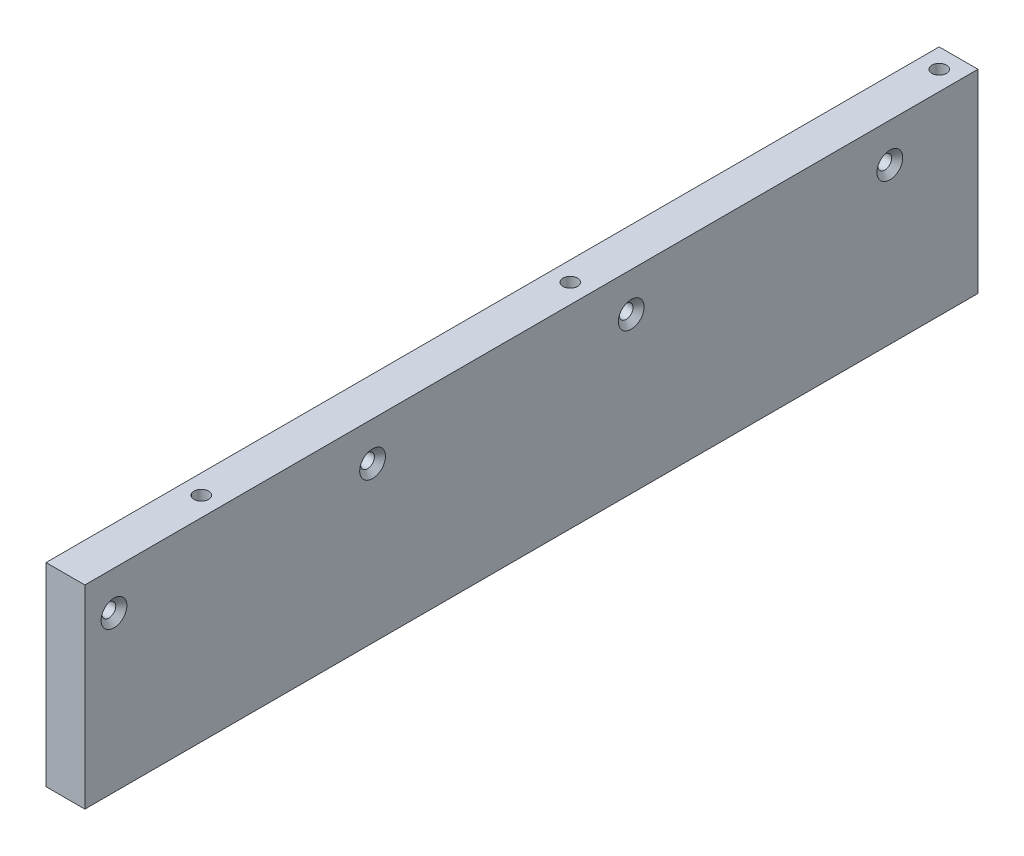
ISO-10303-21;
HEADER;
FILE_DESCRIPTION(('STEP AP214'),'2;1');
FILE_NAME('part.step','',(''),(''),'','','');
FILE_SCHEMA(('AUTOMOTIVE_DESIGN { 1 0 10303 214 1 1 1 1 }'));
ENDSEC;
DATA;
#1=APPLICATION_CONTEXT('core data for automotive mechanical design processes');
#2=APPLICATION_PROTOCOL_DEFINITION('international standard','automotive_design',2000,#1);
#3=PRODUCT_CONTEXT('',#1,'mechanical');
#4=PRODUCT('Part','Part','',(#3));
#5=PRODUCT_RELATED_PRODUCT_CATEGORY('part','',(#4));
#6=PRODUCT_DEFINITION_FORMATION('','',#4);
#7=PRODUCT_DEFINITION_CONTEXT('part definition',#1,'design');
#8=PRODUCT_DEFINITION('design','',#6,#7);
#9=PRODUCT_DEFINITION_SHAPE('','',#8);
#10=(LENGTH_UNIT() NAMED_UNIT(*) SI_UNIT(.MILLI.,.METRE.));
#11=(NAMED_UNIT(*) PLANE_ANGLE_UNIT() SI_UNIT($,.RADIAN.));
#12=(NAMED_UNIT(*) SI_UNIT($,.STERADIAN.) SOLID_ANGLE_UNIT());
#13=UNCERTAINTY_MEASURE_WITH_UNIT(LENGTH_MEASURE(1.E-05),#10,'distance_accuracy_value','');
#14=(GEOMETRIC_REPRESENTATION_CONTEXT(3) GLOBAL_UNCERTAINTY_ASSIGNED_CONTEXT((#13)) GLOBAL_UNIT_ASSIGNED_CONTEXT((#10,
#11,#12)) REPRESENTATION_CONTEXT('',''));
#15=CARTESIAN_POINT('',(0.,0.,0.));
#16=DIRECTION('',(0.,0.,1.));
#17=DIRECTION('',(1.,0.,0.));
#18=AXIS2_PLACEMENT_3D('',#15,#16,#17);
#19=CARTESIAN_POINT('',(61.9125,0.,88.8999999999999));
#20=DIRECTION('',(0.,-1.,0.));
#21=DIRECTION('',(0.,0.,-1.));
#22=AXIS2_PLACEMENT_3D('',#19,#20,#21);
#23=CYLINDRICAL_SURFACE('',#22,1.63194999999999);
#24=CARTESIAN_POINT('',(61.9125,0.,88.8999999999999));
#25=DIRECTION('',(0.,-1.,0.));
#26=DIRECTION('',(0.,0.,-1.));
#27=AXIS2_PLACEMENT_3D('',#24,#25,#26);
#28=CIRCLE('',#27,1.63194999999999);
#29=CARTESIAN_POINT('',(61.9125,0.,87.26805));
#30=VERTEX_POINT('',#29);
#31=EDGE_CURVE('E170',#30,#30,#28,.T.);
#32=ORIENTED_EDGE('',*,*,#31,.T.);
#33=EDGE_LOOP('',(#32));
#34=FACE_BOUND('',#33,.T.);
#35=CARTESIAN_POINT('',(61.9125,12.7,88.8999999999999));
#36=DIRECTION('',(0.,1.,0.));
#37=DIRECTION('',(0.,0.,1.));
#38=AXIS2_PLACEMENT_3D('',#35,#36,#37);
#39=CIRCLE('',#38,1.63194999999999);
#40=CARTESIAN_POINT('',(61.9125,12.7,90.5319499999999));
#41=VERTEX_POINT('',#40);
#42=EDGE_CURVE('E38',#41,#41,#39,.F.);
#43=ORIENTED_EDGE('',*,*,#42,.F.);
#44=EDGE_LOOP('',(#43));
#45=FACE_BOUND('',#44,.T.);
#46=ADVANCED_FACE('F34',(#34,#45),#23,.F.);
#47=CARTESIAN_POINT('',(61.9125,0.,-31.75));
#48=DIRECTION('',(0.,-1.,0.));
#49=DIRECTION('',(0.,0.,-1.));
#50=AXIS2_PLACEMENT_3D('',#47,#48,#49);
#51=CYLINDRICAL_SURFACE('',#50,1.63194999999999);
#52=CARTESIAN_POINT('',(61.9125,0.,-31.75));
#53=DIRECTION('',(0.,-1.,0.));
#54=DIRECTION('',(0.,0.,-1.));
#55=AXIS2_PLACEMENT_3D('',#52,#53,#54);
#56=CIRCLE('',#55,1.63194999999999);
#57=CARTESIAN_POINT('',(61.9125,0.,-33.38195));
#58=VERTEX_POINT('',#57);
#59=EDGE_CURVE('E173',#58,#58,#56,.T.);
#60=ORIENTED_EDGE('',*,*,#59,.T.);
#61=EDGE_LOOP('',(#60));
#62=FACE_BOUND('',#61,.T.);
#63=CARTESIAN_POINT('',(61.9125,12.7,-31.75));
#64=DIRECTION('',(0.,1.,0.));
#65=DIRECTION('',(0.,0.,1.));
#66=AXIS2_PLACEMENT_3D('',#63,#64,#65);
#67=CIRCLE('',#66,1.63194999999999);
#68=CARTESIAN_POINT('',(61.9125,12.7,-30.11805));
#69=VERTEX_POINT('',#68);
#70=EDGE_CURVE('E114',#69,#69,#67,.F.);
#71=ORIENTED_EDGE('',*,*,#70,.F.);
#72=EDGE_LOOP('',(#71));
#73=FACE_BOUND('',#72,.T.);
#74=ADVANCED_FACE('F202',(#62,#73),#51,.F.);
#75=CARTESIAN_POINT('',(61.9125,0.,-152.4));
#76=DIRECTION('',(0.,-1.,0.));
#77=DIRECTION('',(0.,0.,-1.));
#78=AXIS2_PLACEMENT_3D('',#75,#76,#77);
#79=CYLINDRICAL_SURFACE('',#78,1.63194999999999);
#80=CARTESIAN_POINT('',(61.9125,0.,-152.4));
#81=DIRECTION('',(0.,-1.,0.));
#82=DIRECTION('',(0.,0.,-1.));
#83=AXIS2_PLACEMENT_3D('',#80,#81,#82);
#84=CIRCLE('',#83,1.63194999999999);
#85=CARTESIAN_POINT('',(61.9125,0.,-154.03195));
#86=VERTEX_POINT('',#85);
#87=EDGE_CURVE('E104',#86,#86,#84,.T.);
#88=ORIENTED_EDGE('',*,*,#87,.T.);
#89=EDGE_LOOP('',(#88));
#90=FACE_BOUND('',#89,.T.);
#91=CARTESIAN_POINT('',(61.9125,12.7,-152.4));
#92=DIRECTION('',(0.,1.,0.));
#93=DIRECTION('',(0.,0.,1.));
#94=AXIS2_PLACEMENT_3D('',#91,#92,#93);
#95=CIRCLE('',#94,1.63194999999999);
#96=CARTESIAN_POINT('',(61.9125,12.7,-150.76805));
#97=VERTEX_POINT('',#96);
#98=EDGE_CURVE('E110',#97,#97,#95,.F.);
#99=ORIENTED_EDGE('',*,*,#98,.F.);
#100=EDGE_LOOP('',(#99));
#101=FACE_BOUND('',#100,.T.);
#102=ADVANCED_FACE('F179',(#90,#101),#79,.F.);
#103=CARTESIAN_POINT('',(68.2625,63.5,133.35));
#104=DIRECTION('',(-1.,0.,0.));
#105=DIRECTION('',(0.,0.,1.));
#106=AXIS2_PLACEMENT_3D('',#103,#104,#105);
#107=PLANE('',#106);
#108=CARTESIAN_POINT('',(68.2625,50.8,123.825));
#109=DIRECTION('',(1.,0.,0.));
#110=DIRECTION('',(0.,0.,-1.));
#111=AXIS2_PLACEMENT_3D('',#108,#109,#110);
#112=CIRCLE('',#111,4.2164);
#113=CARTESIAN_POINT('',(68.2625,50.8,119.6086));
#114=VERTEX_POINT('',#113);
#115=EDGE_CURVE('E140',#114,#114,#112,.T.);
#116=ORIENTED_EDGE('',*,*,#115,.F.);
#117=EDGE_LOOP('',(#116));
#118=FACE_BOUND('',#117,.T.);
#119=CARTESIAN_POINT('',(68.2625,50.8,-45.3390000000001));
#120=DIRECTION('',(1.,0.,0.));
#121=DIRECTION('',(0.,0.,-1.));
#122=AXIS2_PLACEMENT_3D('',#119,#120,#121);
#123=CIRCLE('',#122,4.2164);
#124=CARTESIAN_POINT('',(68.2625,50.8,-49.5554000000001));
#125=VERTEX_POINT('',#124);
#126=EDGE_CURVE('E149',#125,#125,#123,.T.);
#127=ORIENTED_EDGE('',*,*,#126,.F.);
#128=EDGE_LOOP('',(#127));
#129=FACE_BOUND('',#128,.T.);
#130=CARTESIAN_POINT('',(68.2625,50.8,-129.921));
#131=DIRECTION('',(1.,0.,0.));
#132=DIRECTION('',(0.,0.,-1.));
#133=AXIS2_PLACEMENT_3D('',#130,#131,#132);
#134=CIRCLE('',#133,4.2164);
#135=CARTESIAN_POINT('',(68.2625,50.8,-134.1374));
#136=VERTEX_POINT('',#135);
#137=EDGE_CURVE('E158',#136,#136,#134,.T.);
#138=ORIENTED_EDGE('',*,*,#137,.F.);
#139=EDGE_LOOP('',(#138));
#140=FACE_BOUND('',#139,.T.);
#141=CARTESIAN_POINT('',(68.2625,50.8,39.243));
#142=DIRECTION('',(1.,0.,0.));
#143=DIRECTION('',(0.,0.,-1.));
#144=AXIS2_PLACEMENT_3D('',#141,#142,#143);
#145=CIRCLE('',#144,4.2164);
#146=CARTESIAN_POINT('',(68.2625,50.8,35.0266));
#147=VERTEX_POINT('',#146);
#148=EDGE_CURVE('E167',#147,#147,#145,.T.);
#149=ORIENTED_EDGE('',*,*,#148,.F.);
#150=EDGE_LOOP('',(#149));
#151=FACE_BOUND('',#150,.T.);
#152=DIRECTION('',(0.,0.,-1.));
#153=VECTOR('',#152,1.);
#154=CARTESIAN_POINT('',(68.2625,0.,133.35));
#155=LINE('',#154,#153);
#156=CARTESIAN_POINT('',(68.2625,0.,133.35));
#157=VERTEX_POINT('',#156);
#158=CARTESIAN_POINT('',(68.2625,0.,-158.75));
#159=VERTEX_POINT('',#158);
#160=EDGE_CURVE('E101',#157,#159,#155,.T.);
#161=ORIENTED_EDGE('',*,*,#160,.T.);
#162=DIRECTION('',(0.,-1.,0.));
#163=VECTOR('',#162,1.);
#164=CARTESIAN_POINT('',(68.2625,63.5,-158.75));
#165=LINE('',#164,#163);
#166=CARTESIAN_POINT('',(68.2625,63.5,-158.75));
#167=VERTEX_POINT('',#166);
#168=EDGE_CURVE('E11',#167,#159,#165,.T.);
#169=ORIENTED_EDGE('',*,*,#168,.F.);
#170=DIRECTION('',(0.,0.,-1.));
#171=VECTOR('',#170,1.);
#172=CARTESIAN_POINT('',(68.2625,63.5,133.35));
#173=LINE('',#172,#171);
#174=CARTESIAN_POINT('',(68.2625,63.5,133.35));
#175=VERTEX_POINT('',#174);
#176=EDGE_CURVE('E88',#175,#167,#173,.T.);
#177=ORIENTED_EDGE('',*,*,#176,.F.);
#178=DIRECTION('',(0.,-1.,0.));
#179=VECTOR('',#178,1.);
#180=CARTESIAN_POINT('',(68.2625,63.5,133.35));
#181=LINE('',#180,#179);
#182=EDGE_CURVE('E97',#175,#157,#181,.T.);
#183=ORIENTED_EDGE('',*,*,#182,.T.);
#184=EDGE_LOOP('',(#161,#169,#177,#183));
#185=FACE_BOUND('',#184,.T.);
#186=ADVANCED_FACE('F36',(#118,#129,#140,#151,#185),#107,.F.);
#187=CARTESIAN_POINT('',(68.2625,63.5,-158.75));
#188=DIRECTION('',(0.,0.,1.));
#189=DIRECTION('',(1.,0.,0.));
#190=AXIS2_PLACEMENT_3D('',#187,#188,#189);
#191=PLANE('',#190);
#192=DIRECTION('',(-1.,0.,0.));
#193=VECTOR('',#192,1.);
#194=CARTESIAN_POINT('',(68.2625,0.,-158.75));
#195=LINE('',#194,#193);
#196=CARTESIAN_POINT('',(55.5625,0.,-158.75));
#197=VERTEX_POINT('',#196);
#198=EDGE_CURVE('E92',#159,#197,#195,.T.);
#199=ORIENTED_EDGE('',*,*,#198,.T.);
#200=DIRECTION('',(0.,-1.,0.));
#201=VECTOR('',#200,1.);
#202=CARTESIAN_POINT('',(55.5625,63.5,-158.75));
#203=LINE('',#202,#201);
#204=CARTESIAN_POINT('',(55.5625,63.5,-158.75));
#205=VERTEX_POINT('',#204);
#206=EDGE_CURVE('E44',#205,#197,#203,.T.);
#207=ORIENTED_EDGE('',*,*,#206,.F.);
#208=DIRECTION('',(-1.,0.,0.));
#209=VECTOR('',#208,1.);
#210=CARTESIAN_POINT('',(68.2625,63.5,-158.75));
#211=LINE('',#210,#209);
#212=EDGE_CURVE('E83',#167,#205,#211,.T.);
#213=ORIENTED_EDGE('',*,*,#212,.F.);
#214=ORIENTED_EDGE('',*,*,#168,.T.);
#215=EDGE_LOOP('',(#199,#207,#213,#214));
#216=FACE_BOUND('',#215,.T.);
#217=ADVANCED_FACE('F91',(#216),#191,.F.);
#218=CARTESIAN_POINT('',(55.5625,63.5,133.35));
#219=DIRECTION('',(1.,0.,0.));
#220=DIRECTION('',(0.,0.,-1.));
#221=AXIS2_PLACEMENT_3D('',#218,#219,#220);
#222=PLANE('',#221);
#223=CARTESIAN_POINT('',(55.5625,50.8,123.825));
#224=DIRECTION('',(1.,0.,0.));
#225=DIRECTION('',(0.,0.,-1.));
#226=AXIS2_PLACEMENT_3D('',#223,#224,#225);
#227=CIRCLE('',#226,2.2479);
#228=CARTESIAN_POINT('',(55.5625,50.8,121.5771));
#229=VERTEX_POINT('',#228);
#230=EDGE_CURVE('E112',#229,#229,#227,.T.);
#231=ORIENTED_EDGE('',*,*,#230,.T.);
#232=EDGE_LOOP('',(#231));
#233=FACE_BOUND('',#232,.T.);
#234=CARTESIAN_POINT('',(55.5625,50.8,-45.3390000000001));
#235=DIRECTION('',(1.,0.,0.));
#236=DIRECTION('',(0.,0.,-1.));
#237=AXIS2_PLACEMENT_3D('',#234,#235,#236);
#238=CIRCLE('',#237,2.2479);
#239=CARTESIAN_POINT('',(55.5625,50.8,-47.5869));
#240=VERTEX_POINT('',#239);
#241=EDGE_CURVE('E143',#240,#240,#238,.T.);
#242=ORIENTED_EDGE('',*,*,#241,.T.);
#243=EDGE_LOOP('',(#242));
#244=FACE_BOUND('',#243,.T.);
#245=CARTESIAN_POINT('',(55.5625,50.8,-129.921));
#246=DIRECTION('',(1.,0.,0.));
#247=DIRECTION('',(0.,0.,-1.));
#248=AXIS2_PLACEMENT_3D('',#245,#246,#247);
#249=CIRCLE('',#248,2.2479);
#250=CARTESIAN_POINT('',(55.5625,50.8,-132.1689));
#251=VERTEX_POINT('',#250);
#252=EDGE_CURVE('E152',#251,#251,#249,.T.);
#253=ORIENTED_EDGE('',*,*,#252,.T.);
#254=EDGE_LOOP('',(#253));
#255=FACE_BOUND('',#254,.T.);
#256=CARTESIAN_POINT('',(55.5625,50.8,39.243));
#257=DIRECTION('',(1.,0.,0.));
#258=DIRECTION('',(0.,0.,-1.));
#259=AXIS2_PLACEMENT_3D('',#256,#257,#258);
#260=CIRCLE('',#259,2.2479);
#261=CARTESIAN_POINT('',(55.5625,50.8,36.9951));
#262=VERTEX_POINT('',#261);
#263=EDGE_CURVE('E161',#262,#262,#260,.T.);
#264=ORIENTED_EDGE('',*,*,#263,.T.);
#265=EDGE_LOOP('',(#264));
#266=FACE_BOUND('',#265,.T.);
#267=DIRECTION('',(0.,0.,1.));
#268=VECTOR('',#267,1.);
#269=CARTESIAN_POINT('',(55.5625,0.,133.35));
#270=LINE('',#269,#268);
#271=CARTESIAN_POINT('',(55.5625,0.,133.35));
#272=VERTEX_POINT('',#271);
#273=EDGE_CURVE('E70',#197,#272,#270,.T.);
#274=ORIENTED_EDGE('',*,*,#273,.T.);
#275=DIRECTION('',(0.,-1.,0.));
#276=VECTOR('',#275,1.);
#277=CARTESIAN_POINT('',(55.5625,63.5,133.35));
#278=LINE('',#277,#276);
#279=CARTESIAN_POINT('',(55.5625,63.5,133.35));
#280=VERTEX_POINT('',#279);
#281=EDGE_CURVE('E93',#280,#272,#278,.T.);
#282=ORIENTED_EDGE('',*,*,#281,.F.);
#283=DIRECTION('',(0.,0.,1.));
#284=VECTOR('',#283,1.);
#285=CARTESIAN_POINT('',(55.5625,63.5,133.35));
#286=LINE('',#285,#284);
#287=EDGE_CURVE('E86',#205,#280,#286,.T.);
#288=ORIENTED_EDGE('',*,*,#287,.F.);
#289=ORIENTED_EDGE('',*,*,#206,.T.);
#290=EDGE_LOOP('',(#274,#282,#288,#289));
#291=FACE_BOUND('',#290,.T.);
#292=ADVANCED_FACE('F95',(#233,#244,#255,#266,#291),#222,.F.);
#293=CARTESIAN_POINT('',(68.2625,63.5,133.35));
#294=DIRECTION('',(0.,0.,-1.));
#295=DIRECTION('',(-1.,0.,0.));
#296=AXIS2_PLACEMENT_3D('',#293,#294,#295);
#297=PLANE('',#296);
#298=DIRECTION('',(1.,0.,0.));
#299=VECTOR('',#298,1.);
#300=CARTESIAN_POINT('',(68.2625,0.,133.35));
#301=LINE('',#300,#299);
#302=EDGE_CURVE('E76',#272,#157,#301,.T.);
#303=ORIENTED_EDGE('',*,*,#302,.T.);
#304=ORIENTED_EDGE('',*,*,#182,.F.);
#305=DIRECTION('',(1.,0.,0.));
#306=VECTOR('',#305,1.);
#307=CARTESIAN_POINT('',(68.2625,63.5,133.35));
#308=LINE('',#307,#306);
#309=EDGE_CURVE('E53',#280,#175,#308,.T.);
#310=ORIENTED_EDGE('',*,*,#309,.F.);
#311=ORIENTED_EDGE('',*,*,#281,.T.);
#312=EDGE_LOOP('',(#303,#304,#310,#311));
#313=FACE_BOUND('',#312,.T.);
#314=ADVANCED_FACE('F190',(#313),#297,.F.);
#315=CARTESIAN_POINT('',(68.2625,63.5,-158.75));
#316=DIRECTION('',(0.,1.,0.));
#317=DIRECTION('',(0.,0.,1.));
#318=AXIS2_PLACEMENT_3D('',#315,#316,#317);
#319=PLANE('',#318);
#320=CARTESIAN_POINT('',(61.9125,63.5,88.9));
#321=DIRECTION('',(0.,1.,0.));
#322=DIRECTION('',(0.,0.,1.));
#323=AXIS2_PLACEMENT_3D('',#320,#321,#322);
#324=CIRCLE('',#323,2.37490000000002);
#325=CARTESIAN_POINT('',(61.9125,63.5,91.2749));
#326=VERTEX_POINT('',#325);
#327=EDGE_CURVE('E130',#326,#326,#324,.T.);
#328=ORIENTED_EDGE('',*,*,#327,.F.);
#329=EDGE_LOOP('',(#328));
#330=FACE_BOUND('',#329,.T.);
#331=CARTESIAN_POINT('',(61.9125,63.5,-31.75));
#332=DIRECTION('',(0.,1.,0.));
#333=DIRECTION('',(0.,0.,1.));
#334=AXIS2_PLACEMENT_3D('',#331,#332,#333);
#335=CIRCLE('',#334,2.37490000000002);
#336=CARTESIAN_POINT('',(61.9125,63.5,-29.3751));
#337=VERTEX_POINT('',#336);
#338=EDGE_CURVE('E123',#337,#337,#335,.T.);
#339=ORIENTED_EDGE('',*,*,#338,.F.);
#340=EDGE_LOOP('',(#339));
#341=FACE_BOUND('',#340,.T.);
#342=CARTESIAN_POINT('',(61.9125,63.5,-152.4));
#343=DIRECTION('',(0.,1.,0.));
#344=DIRECTION('',(0.,0.,1.));
#345=AXIS2_PLACEMENT_3D('',#342,#343,#344);
#346=CIRCLE('',#345,2.37490000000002);
#347=CARTESIAN_POINT('',(61.9125,63.5,-150.0251));
#348=VERTEX_POINT('',#347);
#349=EDGE_CURVE('E116',#348,#348,#346,.T.);
#350=ORIENTED_EDGE('',*,*,#349,.F.);
#351=EDGE_LOOP('',(#350));
#352=FACE_BOUND('',#351,.T.);
#353=ORIENTED_EDGE('',*,*,#176,.T.);
#354=ORIENTED_EDGE('',*,*,#212,.T.);
#355=ORIENTED_EDGE('',*,*,#287,.T.);
#356=ORIENTED_EDGE('',*,*,#309,.T.);
#357=EDGE_LOOP('',(#353,#354,#355,#356));
#358=FACE_BOUND('',#357,.T.);
#359=ADVANCED_FACE('F84',(#330,#341,#352,#358),#319,.T.);
#360=CARTESIAN_POINT('',(68.2625,0.,-158.75));
#361=DIRECTION('',(0.,1.,0.));
#362=DIRECTION('',(0.,0.,1.));
#363=AXIS2_PLACEMENT_3D('',#360,#361,#362);
#364=PLANE('',#363);
#365=ORIENTED_EDGE('',*,*,#31,.F.);
#366=EDGE_LOOP('',(#365));
#367=FACE_BOUND('',#366,.T.);
#368=ORIENTED_EDGE('',*,*,#59,.F.);
#369=EDGE_LOOP('',(#368));
#370=FACE_BOUND('',#369,.T.);
#371=ORIENTED_EDGE('',*,*,#87,.F.);
#372=EDGE_LOOP('',(#371));
#373=FACE_BOUND('',#372,.T.);
#374=ORIENTED_EDGE('',*,*,#160,.F.);
#375=ORIENTED_EDGE('',*,*,#302,.F.);
#376=ORIENTED_EDGE('',*,*,#273,.F.);
#377=ORIENTED_EDGE('',*,*,#198,.F.);
#378=EDGE_LOOP('',(#374,#375,#376,#377));
#379=FACE_BOUND('',#378,.T.);
#380=ADVANCED_FACE('F182',(#367,#370,#373,#379),#364,.F.);
#381=CARTESIAN_POINT('',(68.2625,50.8,39.243));
#382=DIRECTION('',(1.,0.,0.));
#383=DIRECTION('',(0.,0.,-1.));
#384=AXIS2_PLACEMENT_3D('',#381,#382,#383);
#385=CONICAL_SURFACE('',#384,4.2164,0.872664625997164);
#386=CARTESIAN_POINT('',(66.6107323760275,50.8,39.243));
#387=DIRECTION('',(1.,0.,0.));
#388=DIRECTION('',(0.,0.,-1.));
#389=AXIS2_PLACEMENT_3D('',#386,#387,#388);
#390=CIRCLE('',#389,2.2479);
#391=CARTESIAN_POINT('',(66.6107323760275,50.8,36.9951));
#392=VERTEX_POINT('',#391);
#393=EDGE_CURVE('E164',#392,#392,#390,.T.);
#394=ORIENTED_EDGE('',*,*,#393,.F.);
#395=EDGE_LOOP('',(#394));
#396=FACE_BOUND('',#395,.T.);
#397=ORIENTED_EDGE('',*,*,#148,.T.);
#398=EDGE_LOOP('',(#397));
#399=FACE_BOUND('',#398,.T.);
#400=ADVANCED_FACE('F185',(#396,#399),#385,.F.);
#401=CARTESIAN_POINT('',(68.2625,50.8,39.243));
#402=DIRECTION('',(1.,0.,0.));
#403=DIRECTION('',(0.,0.,-1.));
#404=AXIS2_PLACEMENT_3D('',#401,#402,#403);
#405=CYLINDRICAL_SURFACE('',#404,2.2479);
#406=ORIENTED_EDGE('',*,*,#263,.F.);
#407=EDGE_LOOP('',(#406));
#408=FACE_BOUND('',#407,.T.);
#409=ORIENTED_EDGE('',*,*,#393,.T.);
#410=EDGE_LOOP('',(#409));
#411=FACE_BOUND('',#410,.T.);
#412=ADVANCED_FACE('F231',(#408,#411),#405,.F.);
#413=CARTESIAN_POINT('',(68.2625,50.8,-129.921));
#414=DIRECTION('',(1.,0.,0.));
#415=DIRECTION('',(0.,0.,-1.));
#416=AXIS2_PLACEMENT_3D('',#413,#414,#415);
#417=CONICAL_SURFACE('',#416,4.2164,0.872664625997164);
#418=CARTESIAN_POINT('',(66.6107323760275,50.8,-129.921));
#419=DIRECTION('',(1.,0.,0.));
#420=DIRECTION('',(0.,0.,-1.));
#421=AXIS2_PLACEMENT_3D('',#418,#419,#420);
#422=CIRCLE('',#421,2.2479);
#423=CARTESIAN_POINT('',(66.6107323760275,50.8,-132.1689));
#424=VERTEX_POINT('',#423);
#425=EDGE_CURVE('E155',#424,#424,#422,.T.);
#426=ORIENTED_EDGE('',*,*,#425,.F.);
#427=EDGE_LOOP('',(#426));
#428=FACE_BOUND('',#427,.T.);
#429=ORIENTED_EDGE('',*,*,#137,.T.);
#430=EDGE_LOOP('',(#429));
#431=FACE_BOUND('',#430,.T.);
#432=ADVANCED_FACE('F236',(#428,#431),#417,.F.);
#433=CARTESIAN_POINT('',(68.2625,50.8,-129.921));
#434=DIRECTION('',(1.,0.,0.));
#435=DIRECTION('',(0.,0.,-1.));
#436=AXIS2_PLACEMENT_3D('',#433,#434,#435);
#437=CYLINDRICAL_SURFACE('',#436,2.2479);
#438=ORIENTED_EDGE('',*,*,#252,.F.);
#439=EDGE_LOOP('',(#438));
#440=FACE_BOUND('',#439,.T.);
#441=ORIENTED_EDGE('',*,*,#425,.T.);
#442=EDGE_LOOP('',(#441));
#443=FACE_BOUND('',#442,.T.);
#444=ADVANCED_FACE('F243',(#440,#443),#437,.F.);
#445=CARTESIAN_POINT('',(68.2625,50.8,-45.3390000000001));
#446=DIRECTION('',(1.,0.,0.));
#447=DIRECTION('',(0.,0.,-1.));
#448=AXIS2_PLACEMENT_3D('',#445,#446,#447);
#449=CONICAL_SURFACE('',#448,4.2164,0.872664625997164);
#450=CARTESIAN_POINT('',(66.6107323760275,50.8,-45.3390000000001));
#451=DIRECTION('',(1.,0.,0.));
#452=DIRECTION('',(0.,0.,-1.));
#453=AXIS2_PLACEMENT_3D('',#450,#451,#452);
#454=CIRCLE('',#453,2.2479);
#455=CARTESIAN_POINT('',(66.6107323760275,50.8,-47.5869));
#456=VERTEX_POINT('',#455);
#457=EDGE_CURVE('E146',#456,#456,#454,.T.);
#458=ORIENTED_EDGE('',*,*,#457,.F.);
#459=EDGE_LOOP('',(#458));
#460=FACE_BOUND('',#459,.T.);
#461=ORIENTED_EDGE('',*,*,#126,.T.);
#462=EDGE_LOOP('',(#461));
#463=FACE_BOUND('',#462,.T.);
#464=ADVANCED_FACE('F250',(#460,#463),#449,.F.);
#465=CARTESIAN_POINT('',(68.2625,50.8,-45.3390000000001));
#466=DIRECTION('',(1.,0.,0.));
#467=DIRECTION('',(0.,0.,-1.));
#468=AXIS2_PLACEMENT_3D('',#465,#466,#467);
#469=CYLINDRICAL_SURFACE('',#468,2.2479);
#470=ORIENTED_EDGE('',*,*,#241,.F.);
#471=EDGE_LOOP('',(#470));
#472=FACE_BOUND('',#471,.T.);
#473=ORIENTED_EDGE('',*,*,#457,.T.);
#474=EDGE_LOOP('',(#473));
#475=FACE_BOUND('',#474,.T.);
#476=ADVANCED_FACE('F254',(#472,#475),#469,.F.);
#477=CARTESIAN_POINT('',(68.2625,50.8,123.825));
#478=DIRECTION('',(1.,0.,0.));
#479=DIRECTION('',(0.,0.,-1.));
#480=AXIS2_PLACEMENT_3D('',#477,#478,#479);
#481=CONICAL_SURFACE('',#480,4.2164,0.872664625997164);
#482=CARTESIAN_POINT('',(66.6107323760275,50.8,123.825));
#483=DIRECTION('',(1.,0.,0.));
#484=DIRECTION('',(0.,0.,-1.));
#485=AXIS2_PLACEMENT_3D('',#482,#483,#484);
#486=CIRCLE('',#485,2.2479);
#487=CARTESIAN_POINT('',(66.6107323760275,50.8,121.5771));
#488=VERTEX_POINT('',#487);
#489=EDGE_CURVE('E137',#488,#488,#486,.T.);
#490=ORIENTED_EDGE('',*,*,#489,.F.);
#491=EDGE_LOOP('',(#490));
#492=FACE_BOUND('',#491,.T.);
#493=ORIENTED_EDGE('',*,*,#115,.T.);
#494=EDGE_LOOP('',(#493));
#495=FACE_BOUND('',#494,.T.);
#496=ADVANCED_FACE('F258',(#492,#495),#481,.F.);
#497=CARTESIAN_POINT('',(68.2625,50.8,123.825));
#498=DIRECTION('',(1.,0.,0.));
#499=DIRECTION('',(0.,0.,-1.));
#500=AXIS2_PLACEMENT_3D('',#497,#498,#499);
#501=CYLINDRICAL_SURFACE('',#500,2.2479);
#502=ORIENTED_EDGE('',*,*,#230,.F.);
#503=EDGE_LOOP('',(#502));
#504=FACE_BOUND('',#503,.T.);
#505=ORIENTED_EDGE('',*,*,#489,.T.);
#506=EDGE_LOOP('',(#505));
#507=FACE_BOUND('',#506,.T.);
#508=ADVANCED_FACE('F262',(#504,#507),#501,.F.);
#509=CARTESIAN_POINT('',(61.9125,12.7,-152.4));
#510=DIRECTION('',(0.,1.,0.));
#511=DIRECTION('',(0.,0.,1.));
#512=AXIS2_PLACEMENT_3D('',#509,#510,#511);
#513=PLANE('',#512);
#514=CARTESIAN_POINT('',(61.9125,12.7,-152.4));
#515=DIRECTION('',(0.,1.,0.));
#516=DIRECTION('',(0.,0.,1.));
#517=AXIS2_PLACEMENT_3D('',#514,#515,#516);
#518=CIRCLE('',#517,2.37490000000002);
#519=CARTESIAN_POINT('',(61.9125,12.7,-150.0251));
#520=VERTEX_POINT('',#519);
#521=EDGE_CURVE('E113',#520,#520,#518,.T.);
#522=ORIENTED_EDGE('',*,*,#521,.T.);
#523=EDGE_LOOP('',(#522));
#524=FACE_BOUND('',#523,.T.);
#525=ORIENTED_EDGE('',*,*,#98,.T.);
#526=EDGE_LOOP('',(#525));
#527=FACE_BOUND('',#526,.T.);
#528=ADVANCED_FACE('F266',(#524,#527),#513,.T.);
#529=CARTESIAN_POINT('',(61.9125,12.7,-152.4));
#530=DIRECTION('',(0.,1.,0.));
#531=DIRECTION('',(0.,0.,1.));
#532=AXIS2_PLACEMENT_3D('',#529,#530,#531);
#533=CYLINDRICAL_SURFACE('',#532,2.37490000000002);
#534=ORIENTED_EDGE('',*,*,#521,.F.);
#535=EDGE_LOOP('',(#534));
#536=FACE_BOUND('',#535,.T.);
#537=ORIENTED_EDGE('',*,*,#349,.T.);
#538=EDGE_LOOP('',(#537));
#539=FACE_BOUND('',#538,.T.);
#540=ADVANCED_FACE('F268',(#536,#539),#533,.F.);
#541=CARTESIAN_POINT('',(61.9125,12.7,-31.75));
#542=DIRECTION('',(0.,1.,0.));
#543=DIRECTION('',(0.,0.,1.));
#544=AXIS2_PLACEMENT_3D('',#541,#542,#543);
#545=PLANE('',#544);
#546=CARTESIAN_POINT('',(61.9125,12.7,-31.75));
#547=DIRECTION('',(0.,1.,0.));
#548=DIRECTION('',(0.,0.,1.));
#549=AXIS2_PLACEMENT_3D('',#546,#547,#548);
#550=CIRCLE('',#549,2.37490000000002);
#551=CARTESIAN_POINT('',(61.9125,12.7,-29.3751));
#552=VERTEX_POINT('',#551);
#553=EDGE_CURVE('E117',#552,#552,#550,.T.);
#554=ORIENTED_EDGE('',*,*,#553,.T.);
#555=EDGE_LOOP('',(#554));
#556=FACE_BOUND('',#555,.T.);
#557=ORIENTED_EDGE('',*,*,#70,.T.);
#558=EDGE_LOOP('',(#557));
#559=FACE_BOUND('',#558,.T.);
#560=ADVANCED_FACE('F271',(#556,#559),#545,.T.);
#561=CARTESIAN_POINT('',(61.9125,12.7,-31.75));
#562=DIRECTION('',(0.,1.,0.));
#563=DIRECTION('',(0.,0.,1.));
#564=AXIS2_PLACEMENT_3D('',#561,#562,#563);
#565=CYLINDRICAL_SURFACE('',#564,2.37490000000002);
#566=ORIENTED_EDGE('',*,*,#553,.F.);
#567=EDGE_LOOP('',(#566));
#568=FACE_BOUND('',#567,.T.);
#569=ORIENTED_EDGE('',*,*,#338,.T.);
#570=EDGE_LOOP('',(#569));
#571=FACE_BOUND('',#570,.T.);
#572=ADVANCED_FACE('F276',(#568,#571),#565,.F.);
#573=CARTESIAN_POINT('',(61.9125,12.7,88.9));
#574=DIRECTION('',(0.,1.,0.));
#575=DIRECTION('',(0.,0.,1.));
#576=AXIS2_PLACEMENT_3D('',#573,#574,#575);
#577=PLANE('',#576);
#578=CARTESIAN_POINT('',(61.9125,12.7,88.9));
#579=DIRECTION('',(0.,1.,0.));
#580=DIRECTION('',(0.,0.,1.));
#581=AXIS2_PLACEMENT_3D('',#578,#579,#580);
#582=CIRCLE('',#581,2.37490000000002);
#583=CARTESIAN_POINT('',(61.9125,12.7,91.2749));
#584=VERTEX_POINT('',#583);
#585=EDGE_CURVE('E294',#584,#584,#582,.T.);
#586=ORIENTED_EDGE('',*,*,#585,.T.);
#587=EDGE_LOOP('',(#586));
#588=FACE_BOUND('',#587,.T.);
#589=ORIENTED_EDGE('',*,*,#42,.T.);
#590=EDGE_LOOP('',(#589));
#591=FACE_BOUND('',#590,.T.);
#592=ADVANCED_FACE('F279',(#588,#591),#577,.T.);
#593=CARTESIAN_POINT('',(61.9125,12.7,88.9));
#594=DIRECTION('',(0.,1.,0.));
#595=DIRECTION('',(0.,0.,1.));
#596=AXIS2_PLACEMENT_3D('',#593,#594,#595);
#597=CYLINDRICAL_SURFACE('',#596,2.37490000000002);
#598=ORIENTED_EDGE('',*,*,#585,.F.);
#599=EDGE_LOOP('',(#598));
#600=FACE_BOUND('',#599,.T.);
#601=ORIENTED_EDGE('',*,*,#327,.T.);
#602=EDGE_LOOP('',(#601));
#603=FACE_BOUND('',#602,.T.);
#604=ADVANCED_FACE('F283',(#600,#603),#597,.F.);
#605=CLOSED_SHELL('',(#46,#74,#102,#186,#217,#292,#314,#359,#380,#400,#412,#432,#444,#464,#476,
#496,#508,#528,#540,#560,#572,#592,#604));
#606=MANIFOLD_SOLID_BREP('B2',#605);
#607=ADVANCED_BREP_SHAPE_REPRESENTATION('',(#18,#606),#14);
#608=SHAPE_DEFINITION_REPRESENTATION(#9,#607);
ENDSEC;
END-ISO-10303-21;
